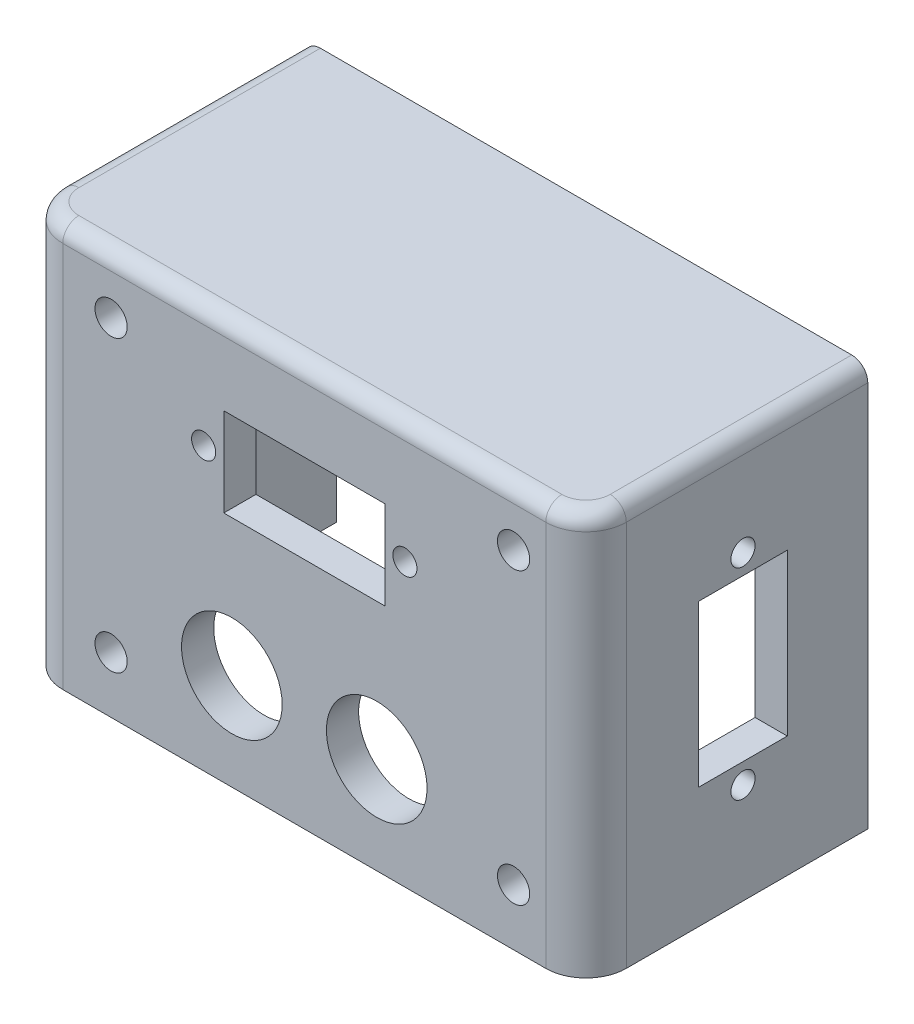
from build123d import *

# Parameters (mm, degrees)
ESQUISSE1_W      = 70
ESQUISSE1_H      = 50
EXTRUSION1_DEPTH = 35
CONG_1_R         = 5
EXTRUSION2_DEPTH = 93.870878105
EXTRUSION3_REACH = 94.871
ESQUISSE3_R      = 2
ESQUISSE5_R      = 1.5
ESQUISSE5_W      = 11
ESQUISSE5_H      = 20
EXTRUSION4_DEPTH = 93.870878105
ESQUISSE8_W      = 62
ESQUISSE8_H      = 31
EXTRUSION7_DEPTH = 2
CONG_3_R         = 2
EXTRUSION8_REACH = 94.871
ESQUISSE9_R      = 6.25
EXTRUSION6_REACH = 94.871
ESQUISSE7_R      = 1.5
ESQUISSE7_W      = 20
ESQUISSE7_H      = 11


with BuildPart() as part:
    # Esquisse1 → Extrusion1 (new body)
    with BuildSketch(Plane.XY):
        with Locations((35, 25)):
            Rectangle(ESQUISSE1_W, ESQUISSE1_H)
    extrude(amount=EXTRUSION1_DEPTH)

    # Cong_1
    cong_1_edges = [part.edges().sort_by_distance(p)[0] for p in [
        (70, 25, 35),
        (0, 25, 35),
    ]]
    fillet(cong_1_edges, radius=CONG_1_R)

    # Esquisse2 → Extrusion2 (cut, through all)
    with BuildSketch(Plane(origin=(0, 50, 0), x_dir=(1, 0, 0), z_dir=(0, 1, 0))):
        with BuildLine():
            Line((66, 0), (4, 0))
            Line((4, 0), (4, -29))
            ThreePointArc((4, -29), (4.585786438, -30.414213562), (6, -31))
            Line((6, -31), (64, -31))
            ThreePointArc((64, -31), (65.414213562, -30.414213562), (66, -29))
            Line((66, -29), (66, 0))
        make_face()
    extrude(amount=-EXTRUSION2_DEPTH, mode=Mode.SUBTRACT)

    # Esquisse3 → Extrusion3 (cut, up to next)
    with BuildSketch(Plane.XY.offset(35), mode=Mode.PRIVATE) as extrusion3_sk1:
        with Locations((11, 43)):
            Circle(ESQUISSE3_R)
    extrusion3_tool1 = extrude(extrusion3_sk1.sketch, amount=-EXTRUSION3_REACH, mode=Mode.PRIVATE) & part.part
    # Esquisse3 → Extrusion3 (cut, up to next)
    with BuildSketch(Plane.XY.offset(35), mode=Mode.PRIVATE) as extrusion3_sk2:
        with Locations((11, 7)):
            Circle(ESQUISSE3_R)
    extrusion3_tool2 = extrude(extrusion3_sk2.sketch, amount=-EXTRUSION3_REACH, mode=Mode.PRIVATE) & part.part
    # Esquisse3 → Extrusion3 (cut, up to next)
    with BuildSketch(Plane.XY.offset(35), mode=Mode.PRIVATE) as extrusion3_sk3:
        with Locations((61, 7)):
            Circle(ESQUISSE3_R)
    extrusion3_tool3 = extrude(extrusion3_sk3.sketch, amount=-EXTRUSION3_REACH, mode=Mode.PRIVATE) & part.part
    # Esquisse3 → Extrusion3 (cut, up to next)
    with BuildSketch(Plane.XY.offset(35), mode=Mode.PRIVATE) as extrusion3_sk4:
        with Locations((61, 43)):
            Circle(ESQUISSE3_R)
    extrusion3_tool4 = extrude(extrusion3_sk4.sketch, amount=-EXTRUSION3_REACH, mode=Mode.PRIVATE) & part.part
    add(extrusion3_tool1.solids().sort_by_distance((11, 43, 35))[0], mode=Mode.SUBTRACT)
    add(extrusion3_tool2.solids().sort_by_distance((11, 7, 35))[0], mode=Mode.SUBTRACT)
    add(extrusion3_tool3.solids().sort_by_distance((61, 7, 35))[0], mode=Mode.SUBTRACT)
    add(extrusion3_tool4.solids().sort_by_distance((61, 43, 35))[0], mode=Mode.SUBTRACT)

    # Esquisse5 → Extrusion4 (cut, through all)
    with BuildSketch(Plane.ZY):
        with Locations(Location((15.5, 12.5, 0), (0, 0, 270))):
            Circle(ESQUISSE5_R)
        with Locations(Location((15.5, 37.5, 0), (0, 0, 270))):
            Circle(ESQUISSE5_R)
        with Locations((15.5, 25)):
            Rectangle(ESQUISSE5_W, ESQUISSE5_H)
    extrude(amount=-EXTRUSION4_DEPTH, mode=Mode.SUBTRACT)

    # Esquisse8 → Extrusion7 (add)
    with BuildSketch(Plane(origin=(0, 50, 0), x_dir=(1, 0, 0), z_dir=(0, 1, 0))):
        with Locations((35, -15.5)):
            Rectangle(ESQUISSE8_W, ESQUISSE8_H)
    extrude(amount=-EXTRUSION7_DEPTH)

    # Cong_3
    cong_3_edges = [part.edges().sort_by_distance(p)[0] for p in [
        (35, 50, 35),
        (0, 50, 15),
        (70, 50, 15),
        (1.464466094, 50, 33.535533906),
        (68.535533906, 50, 33.535533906),
    ]]
    fillet(cong_3_edges, radius=CONG_3_R)

    # Esquisse9 → Extrusion8 (cut, up to next)
    with BuildSketch(Plane.XY.offset(35), mode=Mode.PRIVATE) as extrusion8_sk1:
        with Locations((26, 12)):
            Circle(ESQUISSE9_R)
    extrusion8_tool1 = extrude(extrusion8_sk1.sketch, amount=-EXTRUSION8_REACH, mode=Mode.PRIVATE) & part.part
    # Esquisse9 → Extrusion8 (cut, up to next)
    with BuildSketch(Plane.XY.offset(35), mode=Mode.PRIVATE) as extrusion8_sk2:
        with Locations((44, 12)):
            Circle(ESQUISSE9_R)
    extrusion8_tool2 = extrude(extrusion8_sk2.sketch, amount=-EXTRUSION8_REACH, mode=Mode.PRIVATE) & part.part
    add(extrusion8_tool1.solids().sort_by_distance((26, 12, 35))[0], mode=Mode.SUBTRACT)
    add(extrusion8_tool2.solids().sort_by_distance((44, 12, 35))[0], mode=Mode.SUBTRACT)

    # Esquisse7 → Extrusion6 (cut, up to next)
    with BuildSketch(Plane.XY.offset(35), mode=Mode.PRIVATE) as extrusion6_sk1:
        with Locations((22.5, 35)):
            Circle(ESQUISSE7_R)
    extrusion6_tool1 = extrude(extrusion6_sk1.sketch, amount=-EXTRUSION6_REACH, mode=Mode.PRIVATE) & part.part
    # Esquisse7 → Extrusion6 (cut, up to next)
    with BuildSketch(Plane.XY.offset(35), mode=Mode.PRIVATE) as extrusion6_sk2:
        with Locations((47.5, 35)):
            Circle(ESQUISSE7_R)
    extrusion6_tool2 = extrude(extrusion6_sk2.sketch, amount=-EXTRUSION6_REACH, mode=Mode.PRIVATE) & part.part
    # Esquisse7 → Extrusion6 (cut, up to next)
    with BuildSketch(Plane.XY.offset(35), mode=Mode.PRIVATE) as extrusion6_sk3:
        with Locations((35, 34.5)):
            Rectangle(ESQUISSE7_W, ESQUISSE7_H)
    extrusion6_tool3 = extrude(extrusion6_sk3.sketch, amount=-EXTRUSION6_REACH, mode=Mode.PRIVATE) & part.part
    add(extrusion6_tool1.solids().sort_by_distance((22.5, 35, 35))[0], mode=Mode.SUBTRACT)
    add(extrusion6_tool2.solids().sort_by_distance((47.5, 35, 35))[0], mode=Mode.SUBTRACT)
    add(extrusion6_tool3.solids().sort_by_distance((35, 34.5, 35))[0], mode=Mode.SUBTRACT)


solid = part.part
